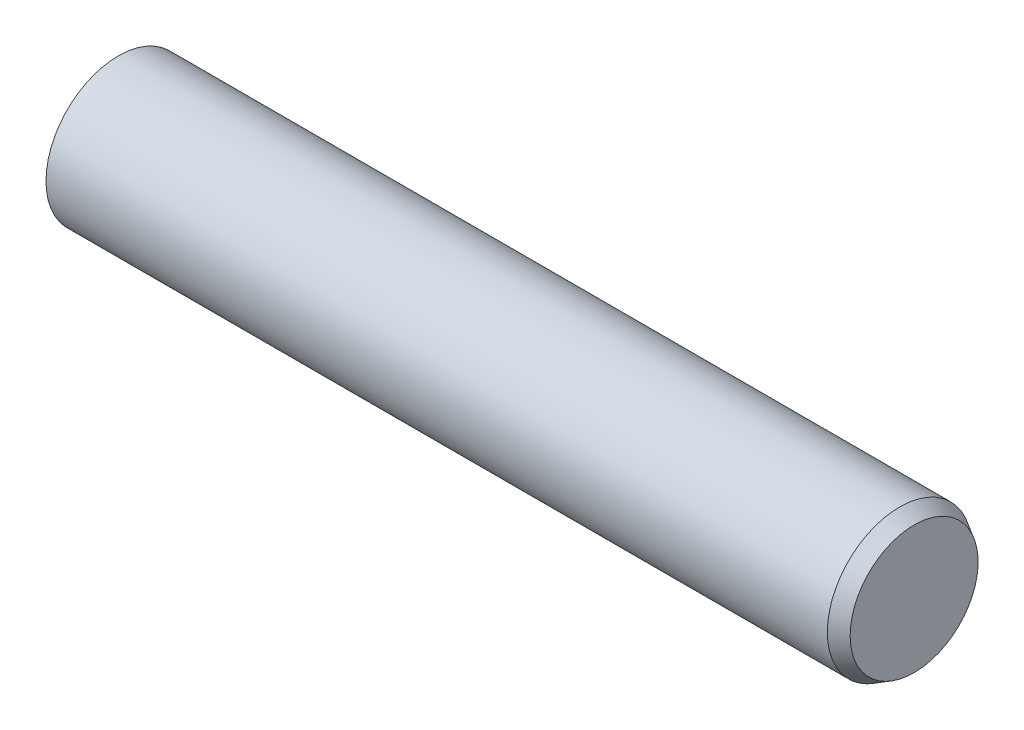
ISO-10303-21;
HEADER;
FILE_DESCRIPTION(('STEP AP214'),'2;1');
FILE_NAME('part.step','',(''),(''),'','','');
FILE_SCHEMA(('AUTOMOTIVE_DESIGN { 1 0 10303 214 1 1 1 1 }'));
ENDSEC;
DATA;
#1=APPLICATION_CONTEXT('core data for automotive mechanical design processes');
#2=APPLICATION_PROTOCOL_DEFINITION('international standard','automotive_design',2000,#1);
#3=PRODUCT_CONTEXT('',#1,'mechanical');
#4=PRODUCT('Part','Part','',(#3));
#5=PRODUCT_RELATED_PRODUCT_CATEGORY('part','',(#4));
#6=PRODUCT_DEFINITION_FORMATION('','',#4);
#7=PRODUCT_DEFINITION_CONTEXT('part definition',#1,'design');
#8=PRODUCT_DEFINITION('design','',#6,#7);
#9=PRODUCT_DEFINITION_SHAPE('','',#8);
#10=(LENGTH_UNIT() NAMED_UNIT(*) SI_UNIT(.MILLI.,.METRE.));
#11=(NAMED_UNIT(*) PLANE_ANGLE_UNIT() SI_UNIT($,.RADIAN.));
#12=(NAMED_UNIT(*) SI_UNIT($,.STERADIAN.) SOLID_ANGLE_UNIT());
#13=UNCERTAINTY_MEASURE_WITH_UNIT(LENGTH_MEASURE(1.E-05),#10,'distance_accuracy_value','');
#14=(GEOMETRIC_REPRESENTATION_CONTEXT(3) GLOBAL_UNCERTAINTY_ASSIGNED_CONTEXT((#13)) GLOBAL_UNIT_ASSIGNED_CONTEXT((#10,
#11,#12)) REPRESENTATION_CONTEXT('',''));
#15=CARTESIAN_POINT('',(0.,0.,0.));
#16=DIRECTION('',(0.,0.,1.));
#17=DIRECTION('',(1.,0.,0.));
#18=AXIS2_PLACEMENT_3D('',#15,#16,#17);
#19=CARTESIAN_POINT('',(168.,15.,0.));
#20=DIRECTION('',(-1.,0.,0.));
#21=DIRECTION('',(0.,0.,1.));
#22=AXIS2_PLACEMENT_3D('',#19,#20,#21);
#23=PLANE('',#22);
#24=CARTESIAN_POINT('',(168.,0.,0.));
#25=DIRECTION('',(-1.,0.,0.));
#26=DIRECTION('',(0.,0.,1.));
#27=AXIS2_PLACEMENT_3D('',#24,#25,#26);
#28=CIRCLE('',#27,13.2679491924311);
#29=CARTESIAN_POINT('',(168.,0.,13.2679491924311));
#30=VERTEX_POINT('',#29);
#31=EDGE_CURVE('E10',#30,#30,#28,.F.);
#32=ORIENTED_EDGE('',*,*,#31,.T.);
#33=EDGE_LOOP('',(#32));
#34=FACE_BOUND('',#33,.T.);
#35=ADVANCED_FACE('F29',(#34),#23,.F.);
#36=CARTESIAN_POINT('',(0.,0.,0.));
#37=DIRECTION('',(-1.,0.,0.));
#38=DIRECTION('',(0.,0.,1.));
#39=AXIS2_PLACEMENT_3D('',#36,#37,#38);
#40=CYLINDRICAL_SURFACE('',#39,15.);
#41=CARTESIAN_POINT('',(165.,0.,0.));
#42=DIRECTION('',(-1.,0.,0.));
#43=DIRECTION('',(0.,0.,1.));
#44=AXIS2_PLACEMENT_3D('',#41,#42,#43);
#45=CIRCLE('',#44,15.);
#46=CARTESIAN_POINT('',(165.,0.,15.));
#47=VERTEX_POINT('',#46);
#48=EDGE_CURVE('E35',#47,#47,#45,.T.);
#49=ORIENTED_EDGE('',*,*,#48,.T.);
#50=EDGE_LOOP('',(#49));
#51=FACE_BOUND('',#50,.T.);
#52=CARTESIAN_POINT('',(3.,0.,0.));
#53=DIRECTION('',(-1.,0.,0.));
#54=DIRECTION('',(0.,0.,1.));
#55=AXIS2_PLACEMENT_3D('',#52,#53,#54);
#56=CIRCLE('',#55,15.);
#57=CARTESIAN_POINT('',(3.,0.,15.));
#58=VERTEX_POINT('',#57);
#59=EDGE_CURVE('E39',#58,#58,#56,.T.);
#60=ORIENTED_EDGE('',*,*,#59,.F.);
#61=EDGE_LOOP('',(#60));
#62=FACE_BOUND('',#61,.T.);
#63=ADVANCED_FACE('F63',(#51,#62),#40,.T.);
#64=CARTESIAN_POINT('',(3.,7.49999999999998,0.));
#65=DIRECTION('',(1.,0.,0.));
#66=DIRECTION('',(0.,0.,-1.));
#67=AXIS2_PLACEMENT_3D('',#64,#65,#66);
#68=PLANE('',#67);
#69=CARTESIAN_POINT('',(3.,0.,0.));
#70=DIRECTION('',(-1.,0.,0.));
#71=DIRECTION('',(0.,0.,1.));
#72=AXIS2_PLACEMENT_3D('',#69,#70,#71);
#73=CIRCLE('',#72,7.49999999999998);
#74=CARTESIAN_POINT('',(3.,0.,7.49999999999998));
#75=VERTEX_POINT('',#74);
#76=EDGE_CURVE('E43',#75,#75,#73,.T.);
#77=ORIENTED_EDGE('',*,*,#76,.F.);
#78=EDGE_LOOP('',(#77));
#79=FACE_BOUND('',#78,.T.);
#80=ORIENTED_EDGE('',*,*,#59,.T.);
#81=EDGE_LOOP('',(#80));
#82=FACE_BOUND('',#81,.T.);
#83=ADVANCED_FACE('F57',(#79,#82),#68,.F.);
#84=CARTESIAN_POINT('',(0.,0.,0.));
#85=DIRECTION('',(-1.,0.,0.));
#86=DIRECTION('',(0.,0.,1.));
#87=AXIS2_PLACEMENT_3D('',#84,#85,#86);
#88=CYLINDRICAL_SURFACE('',#87,7.49999999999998);
#89=CARTESIAN_POINT('',(0.,0.,0.));
#90=DIRECTION('',(-1.,0.,0.));
#91=DIRECTION('',(0.,0.,1.));
#92=AXIS2_PLACEMENT_3D('',#89,#90,#91);
#93=CIRCLE('',#92,7.49999999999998);
#94=CARTESIAN_POINT('',(0.,0.,7.49999999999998));
#95=VERTEX_POINT('',#94);
#96=EDGE_CURVE('E48',#95,#95,#93,.T.);
#97=ORIENTED_EDGE('',*,*,#96,.F.);
#98=EDGE_LOOP('',(#97));
#99=FACE_BOUND('',#98,.T.);
#100=ORIENTED_EDGE('',*,*,#76,.T.);
#101=EDGE_LOOP('',(#100));
#102=FACE_BOUND('',#101,.T.);
#103=ADVANCED_FACE('F54',(#99,#102),#88,.T.);
#104=CARTESIAN_POINT('',(0.,0.,0.));
#105=DIRECTION('',(1.,0.,0.));
#106=DIRECTION('',(0.,0.,-1.));
#107=AXIS2_PLACEMENT_3D('',#104,#105,#106);
#108=PLANE('',#107);
#109=ORIENTED_EDGE('',*,*,#96,.T.);
#110=EDGE_LOOP('',(#109));
#111=FACE_BOUND('',#110,.T.);
#112=ADVANCED_FACE('F52',(#111),#108,.F.);
#113=CARTESIAN_POINT('',(165.,0.,0.));
#114=DIRECTION('',(-1.,0.,0.));
#115=DIRECTION('',(0.,0.,1.));
#116=AXIS2_PLACEMENT_3D('',#113,#114,#115);
#117=CONICAL_SURFACE('',#116,15.,0.5235987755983);
#118=CARTESIAN_POINT('',(168.,0.,13.2679491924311));
#119=CARTESIAN_POINT('',(167.96875,0.,13.2859913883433));
#120=CARTESIAN_POINT('',(167.9375,0.,13.3040335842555));
#121=CARTESIAN_POINT('',(167.875,0.,13.3401179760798));
#122=CARTESIAN_POINT('',(167.84375,0.,13.358160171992));
#123=CARTESIAN_POINT('',(167.78125,0.,13.3942445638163));
#124=CARTESIAN_POINT('',(167.75,0.,13.4122867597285));
#125=CARTESIAN_POINT('',(167.6875,0.,13.4483711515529));
#126=CARTESIAN_POINT('',(167.65625,0.,13.466413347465));
#127=CARTESIAN_POINT('',(167.59375,0.,13.5024977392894));
#128=CARTESIAN_POINT('',(167.5625,0.,13.5205399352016));
#129=CARTESIAN_POINT('',(167.5,0.,13.5566243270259));
#130=CARTESIAN_POINT('',(167.46875,0.,13.5746665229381));
#131=CARTESIAN_POINT('',(167.40625,0.,13.6107509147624));
#132=CARTESIAN_POINT('',(167.375,0.,13.6287931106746));
#133=CARTESIAN_POINT('',(167.3125,0.,13.664877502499));
#134=CARTESIAN_POINT('',(167.28125,0.,13.6829196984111));
#135=CARTESIAN_POINT('',(167.21875,0.,13.7190040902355));
#136=CARTESIAN_POINT('',(167.1875,0.,13.7370462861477));
#137=CARTESIAN_POINT('',(167.125,0.,13.773130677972));
#138=CARTESIAN_POINT('',(167.09375,0.,13.7911728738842));
#139=CARTESIAN_POINT('',(167.03125,0.,13.8272572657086));
#140=CARTESIAN_POINT('',(167.,0.,13.8452994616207));
#141=CARTESIAN_POINT('',(166.9375,0.,13.8813838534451));
#142=CARTESIAN_POINT('',(166.90625,0.,13.8994260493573));
#143=CARTESIAN_POINT('',(166.84375,0.,13.9355104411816));
#144=CARTESIAN_POINT('',(166.8125,0.,13.9535526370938));
#145=CARTESIAN_POINT('',(166.75,0.,13.9896370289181));
#146=CARTESIAN_POINT('',(166.71875,0.,14.0076792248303));
#147=CARTESIAN_POINT('',(166.65625,0.,14.0437636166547));
#148=CARTESIAN_POINT('',(166.625,0.,14.0618058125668));
#149=CARTESIAN_POINT('',(166.5625,0.,14.0978902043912));
#150=CARTESIAN_POINT('',(166.53125,0.,14.1159324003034));
#151=CARTESIAN_POINT('',(166.46875,0.,14.1520167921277));
#152=CARTESIAN_POINT('',(166.4375,0.,14.1700589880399));
#153=CARTESIAN_POINT('',(166.375,0.,14.2061433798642));
#154=CARTESIAN_POINT('',(166.34375,0.,14.2241855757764));
#155=CARTESIAN_POINT('',(166.28125,0.,14.2602699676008));
#156=CARTESIAN_POINT('',(166.25,0.,14.2783121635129));
#157=CARTESIAN_POINT('',(166.1875,0.,14.3143965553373));
#158=CARTESIAN_POINT('',(166.15625,0.,14.3324387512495));
#159=CARTESIAN_POINT('',(166.09375,0.,14.3685231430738));
#160=CARTESIAN_POINT('',(166.0625,0.,14.386565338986));
#161=CARTESIAN_POINT('',(166.,0.,14.4226497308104));
#162=CARTESIAN_POINT('',(165.96875,0.,14.4406919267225));
#163=CARTESIAN_POINT('',(165.90625,0.,14.4767763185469));
#164=CARTESIAN_POINT('',(165.875,0.,14.4948185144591));
#165=CARTESIAN_POINT('',(165.8125,0.,14.5309029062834));
#166=CARTESIAN_POINT('',(165.78125,0.,14.5489451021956));
#167=CARTESIAN_POINT('',(165.71875,0.,14.5850294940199));
#168=CARTESIAN_POINT('',(165.6875,0.,14.6030716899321));
#169=CARTESIAN_POINT('',(165.625,0.,14.6391560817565));
#170=CARTESIAN_POINT('',(165.59375,0.,14.6571982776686));
#171=CARTESIAN_POINT('',(165.53125,0.,14.693282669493));
#172=CARTESIAN_POINT('',(165.5,0.,14.7113248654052));
#173=CARTESIAN_POINT('',(165.4375,0.,14.7474092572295));
#174=CARTESIAN_POINT('',(165.40625,0.,14.7654514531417));
#175=CARTESIAN_POINT('',(165.34375,0.,14.801535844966));
#176=CARTESIAN_POINT('',(165.3125,0.,14.8195780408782));
#177=CARTESIAN_POINT('',(165.25,0.,14.8556624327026));
#178=CARTESIAN_POINT('',(165.21875,0.,14.8737046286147));
#179=CARTESIAN_POINT('',(165.15625,0.,14.9097890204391));
#180=CARTESIAN_POINT('',(165.125,0.,14.9278312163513));
#181=CARTESIAN_POINT('',(165.0625,0.,14.9639156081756));
#182=CARTESIAN_POINT('',(165.03125,0.,14.9819578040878));
#183=CARTESIAN_POINT('',(165.,0.,15.));
#184=B_SPLINE_CURVE_WITH_KNOTS('',3,(#118,#119,#120,#121,#122,#123,#124,#125,#126,#127,#128,
#129,#130,#131,#132,#133,#134,#135,#136,#137,#138,#139,#140,#141,#142,#143,#144,#145,#146,#147,
#148,#149,#150,#151,#152,#153,#154,#155,#156,#157,#158,#159,#160,#161,#162,#163,#164,#165,#166,
#167,#168,#169,#170,#171,#172,#173,#174,#175,#176,#177,#178,#179,#180,#181,#182,#183),
.UNSPECIFIED.,.F.,.F.,(4,2,2,2,2,2,2,2,2,2,2,2,2,2,2,2,2,2,2,2,2,2,2,2,2,2,2,2,2,2,2,2,4),(0.,
0.108253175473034,0.216506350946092,0.324759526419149,0.433012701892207,0.541265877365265,
0.649519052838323,0.757772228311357,0.866025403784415,0.974278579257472,1.08253175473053,
1.19078493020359,1.29903810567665,1.40729128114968,1.51554445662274,1.62379763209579,
1.73205080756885,1.84030398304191,1.94855715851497,2.05681033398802,2.16506350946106,
2.27331668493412,2.38156986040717,2.48982303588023,2.59807621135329,2.70632938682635,
2.81458256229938,2.92283573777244,3.0310889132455,3.13934208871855,3.24759526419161,
3.35584843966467,3.46410161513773),.UNSPECIFIED.);
#185=EDGE_CURVE('BSEAM74',#30,#47,#184,.T.);
#186=ORIENTED_EDGE('',*,*,#31,.F.);
#187=ORIENTED_EDGE('',*,*,#48,.F.);
#188=ORIENTED_EDGE('',*,*,#185,.T.);
#189=ORIENTED_EDGE('',*,*,#185,.F.);
#190=EDGE_LOOP('',(#186,#188,#187,#189));
#191=FACE_BOUND('',#190,.T.);
#192=ADVANCED_FACE('F74',(#191),#117,.T.);
#193=CLOSED_SHELL('',(#35,#63,#83,#103,#112,#192));
#194=MANIFOLD_SOLID_BREP('B2',#193);
#195=ADVANCED_BREP_SHAPE_REPRESENTATION('',(#18,#194),#14);
#196=SHAPE_DEFINITION_REPRESENTATION(#9,#195);
ENDSEC;
END-ISO-10303-21;
